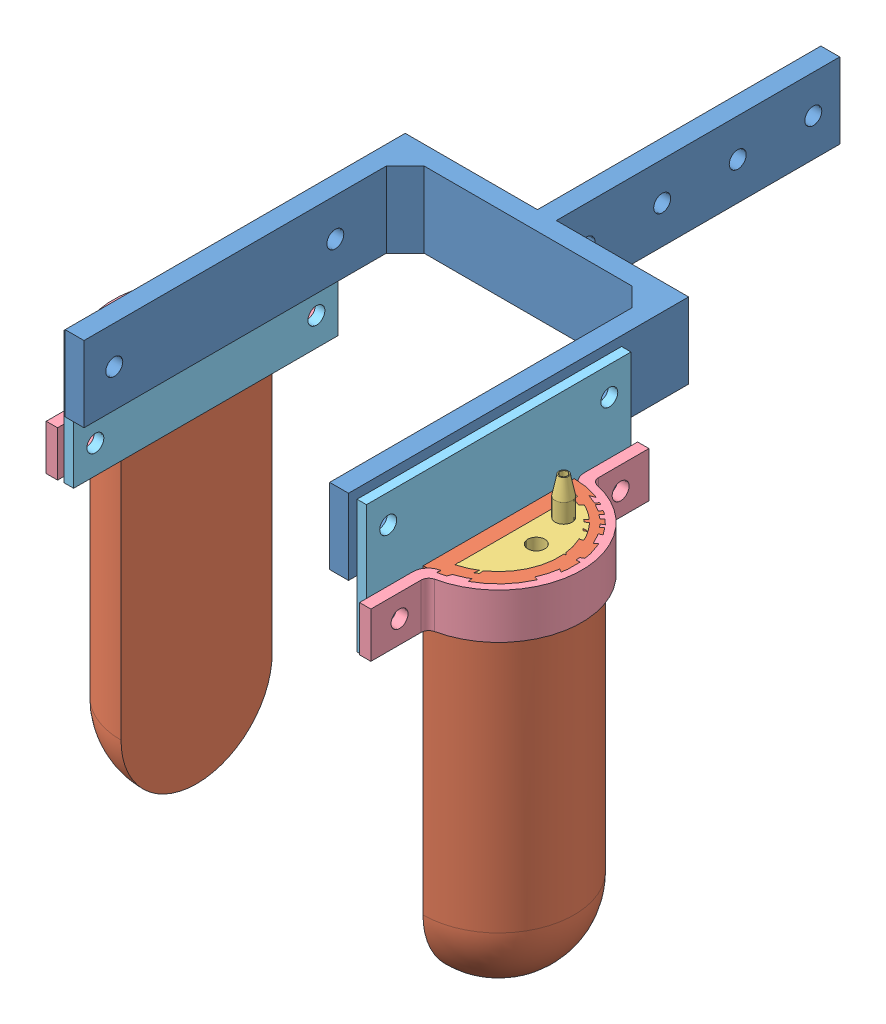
SolidWorks assembly gripper_assy.SLDASM, configuration Default (file format 12000). Lengths in mm.
Overall size (124 124 165).
11 component instances, 5 part files, 6 mates.
Components (placement in the parent):
- finger_fixture-1: finger_fixture.SLDPRT [Default] at (2.1337 44.8856 141.8981) size (75 20 165)
- finger_assy-1: finger_assy.SLDASM [Default] at (-15.5839 -28.6759 88.4638) x (0 0 -1) z (0 1 0) size (73.59 24.5 121.5)
  - finger-1: finger.SLDPRT [Default] at (-16.1399 -15.2175 -30.4385) size (40 20 100)
  - finger_adapter-1: finger_adapter.SLDPRT [Default] at (-16.1399 -15.2175 69.5615) x (0 0 -1) z (1 0 0) size (25.06 14 33.58)
  - clamp-2: clamp.SLDPRT [Default] at (-16.1399 -15.2175 69.5615) x (0 0 -1) z (1 0 0) size (12 22 73.59)
  - clamp_connector-1: clamp_connector.SLDPRT [Default] at (-51.1843 -17.7175 91.0615) size (70 2.5 35)
- finger_assy-2: finger_assy.SLDASM [Default] at (94.8512 -28.6759 120.8324) x (0 0 1) z (0 1 0) size (73.59 24.5 121.5)
  - finger-1: finger.SLDPRT [Default] at (-16.1399 -15.2175 -30.4385) size (40 20 100)
  - finger_adapter-1: finger_adapter.SLDPRT [Default] at (-16.1399 -15.2175 69.5615) x (0 0 -1) z (1 0 0) size (25.06 14 33.58)
  - clamp-2: clamp.SLDPRT [Default] at (-16.1399 -15.2175 69.5615) x (0 0 -1) z (1 0 0) size (12 22 73.59)
  - clamp_connector-1: clamp_connector.SLDPRT [Default] at (-51.1843 -17.7175 91.0615) size (70 2.5 35)
Mates (geometry in assembly coordinates):
- Concentric1: concentric aligned: cylinder of finger_fixture-1 through (77.1337 54.8856 75.3981) axis (-1 0 0) radius 2.25; cylinder of finger_assy-1/clamp_connector-1 through (2.1337 54.8856 75.3981) axis (-1 0 0) radius 2.25
- Concentric2: concentric aligned: cylinder of finger_fixture-1 through (77.1337 54.8856 133.8981) axis (-1 0 0) radius 2.25; cylinder of finger_assy-1/clamp_connector-1 through (2.1337 54.8856 133.8981) axis (-1 0 0) radius 2.25
- Coincident1: coincident anti-aligned: plane of finger_fixture-1 through (2.1337 64.8856 141.8981) normal (-1 0 0); plane of finger_assy-1/clamp_connector-1 through (2.1337 62.3856 139.6481) normal (1 0 0)
- Concentric3: concentric anti-aligned: cylinder of finger_fixture-1 through (77.1337 54.8856 133.8981) axis (-1 0 0) radius 2.25; cylinder of finger_assy-2/clamp_connector-1 through (77.1337 54.8856 133.8981) axis (1 0 0) radius 2.25
- Concentric4: concentric anti-aligned: cylinder of finger_fixture-1 through (77.1337 54.8856 75.3981) axis (-1 0 0) radius 2.25; cylinder of finger_assy-2/clamp_connector-1 through (77.1337 54.8856 75.3981) axis (1 0 0) radius 2.25
- Coincident2: coincident anti-aligned: plane of finger_fixture-1 through (77.1337 64.8856 141.8981) normal (1 0 0); plane of finger_assy-2/clamp_connector-1 through (77.1337 62.3856 69.6481) normal (-1 0 0)
